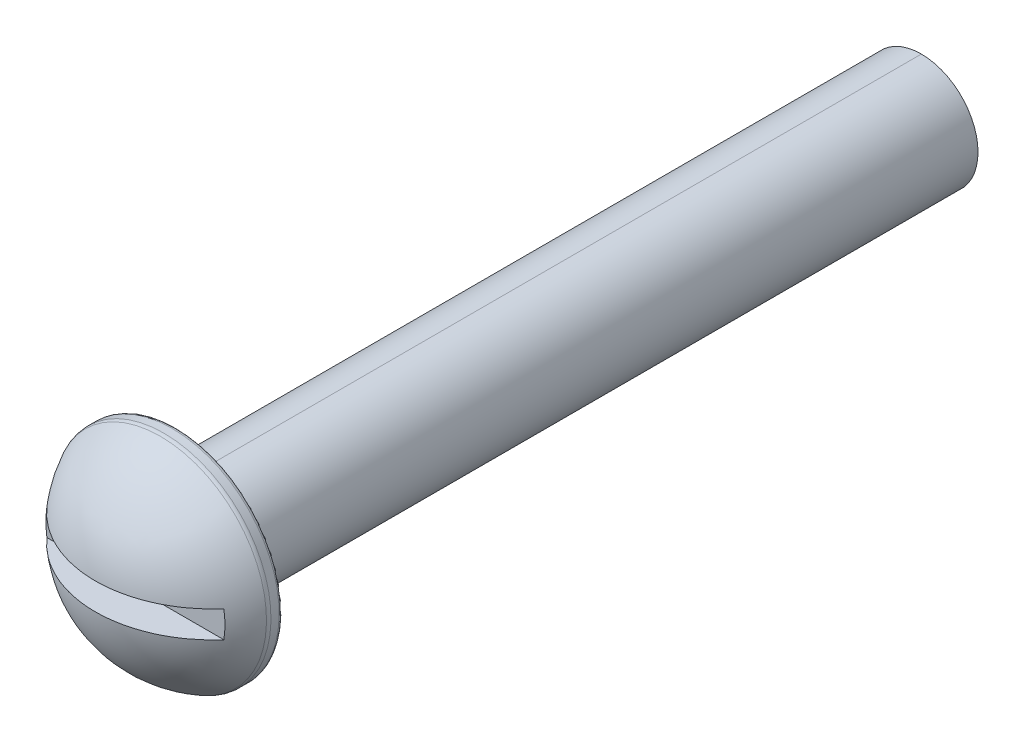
from build123d import *

# Parameters (mm, degrees)
SKETCH1_R       = 4.5593
EXTRUDE3_DEPTH  = 3.4798
SKETCH4_W       = 31.75
SKETCH4_H       = 2.413
SKETCH26_R      = 0.5461
EXTRUDE8_DEPTH  = 3.450189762
SKETCH30_W      = 9.1186
SKETCH30_H      = 1.139825
EXTRUDE12_DEPTH = 1.7399


with BuildPart() as part:
    # Sketch1 → Extrude3 (new body)
    with BuildSketch(Plane.XY):
        Circle(SKETCH1_R)
    extrude(amount=EXTRUDE3_DEPTH)

    # Sketch11 → Cut-Revolve3 (revolve, cut)
    with BuildSketch(Plane(origin=(0, 0, 0), x_dir=(0, 0, -1), z_dir=(1, 0, 0))):
        with BuildLine():
            Line((-3.7338, 5.29717), (0, 5.29717))
            Line((0, 5.29717), (0, 4.38531))
            ThreePointArc((0, 4.38531), (-0.050960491, 4.508339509), (-0.17399, 4.5593))
            Line((-0.17399, 4.5593), (-0.52197, 4.5593))
            ThreePointArc((-0.52197, 4.5593), (-0.601505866, 4.550088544), (-0.676830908, 4.522941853))
            ThreePointArc((-0.676830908, 4.522941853), (-2.722244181, 2.660528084), (-3.4798, 0))
            Line((-3.4798, 0), (-3.7338, 0))
            Line((-3.7338, 0), (-3.7338, 5.29717))
        make_face()
    revolve(axis=Axis((0, 0, 0), (0, 0, 1)), mode=Mode.SUBTRACT)



with BuildPart() as body_2:
    # Sketch4 → Revolve1 (revolve)
    with BuildSketch(Plane(origin=(0, 0, 0), x_dir=(0, 0, -1), z_dir=(1, 0, 0))):
        with Locations((15.875, 1.2065)):
            Rectangle(SKETCH4_W, SKETCH4_H)
    revolve(axis=Axis((0, 0, 0), (0, 0, -1)))


with BuildPart() as part_1:
    add(part.part)

    add(body_2.part)  # Extrude8 merges body 2
    # Sketch26 → Extrude8 (add)
    with BuildSketch(Plane.XY):
        Circle(SKETCH26_R)
    extrude(amount=EXTRUDE8_DEPTH)

    # Sketch30 → Extrude12 (cut)
    with BuildSketch(Plane.XY.offset(3.4798)):
        Rectangle(SKETCH30_W, SKETCH30_H)
    extrude(amount=-EXTRUDE12_DEPTH, mode=Mode.SUBTRACT)


solid = part_1.part
